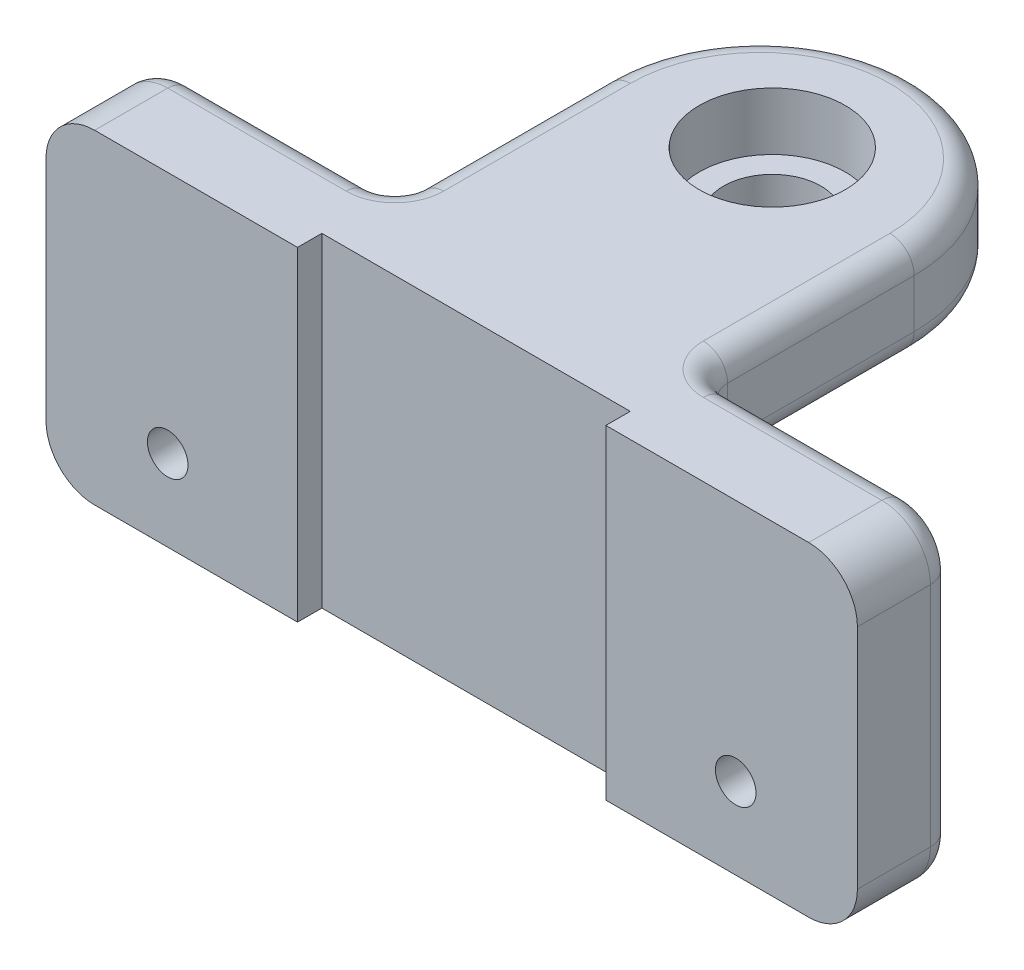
from build123d import *

# Parameters (mm, degrees)
SKETCH1_W                                            = 100
SKETCH1_H                                            = 40
BOSS_EXTRUDE1_DEPTH                                  = 12
BOSS_EXTRUDE2_DEPTH                                  = 12
SKETCH3_W                                            = 38
SKETCH3_H                                            = 3
CUT_EXTRUDE1_DEPTH                                   = 40
CBORE_FOR_M10_HEX_SOCKET_HEAD_CAP_SCREW2_D           = 12
CBORE_FOR_M10_HEX_SOCKET_HEAD_CAP_SCREW2_CBORE_D     = 18
CBORE_FOR_M10_HEX_SOCKET_HEAD_CAP_SCREW2_CBORE_DEPTH = 7.1
FILLET10_R                                           = 6
FILLET11_R                                           = 6
FILLET12_R                                           = 6
FILLET13_R                                           = 6
FILLET14_R                                           = 3
SKETCH11_R                                           = 2.5
CUT_EXTRUDE3_DEPTH                                   = 117.726175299


with BuildPart() as part:
    # Sketch1 → Boss-Extrude1 (new body)
    with BuildSketch(Plane.XY):
        with Locations((50, 20)):
            Rectangle(SKETCH1_W, SKETCH1_H)
    extrude(amount=BOSS_EXTRUDE1_DEPTH)

    # Sketch2 → Boss-Extrude2 (add)
    with BuildSketch(Plane(origin=(0, 40, 0), x_dir=(1, 0, 0), z_dir=(0, 1, 0))):
        with BuildLine():
            Line((31, 0), (31, 26))
            ThreePointArc((31, 26), (50, 45), (69, 26))
            Line((69, 26), (69, 0))
            Line((69, 0), (31, 0))
        make_face()
    extrude(amount=-BOSS_EXTRUDE2_DEPTH)

    # Sketch3 → Cut-Extrude1 (cut)
    with BuildSketch(Plane(origin=(0, 40, 0), x_dir=(1, 0, 0), z_dir=(0, 1, 0))):
        with Locations((50, -10.5)):
            Rectangle(SKETCH3_W, SKETCH3_H)
    extrude(amount=-CUT_EXTRUDE1_DEPTH, mode=Mode.SUBTRACT)

    # CBORE for M10 Hex Socket Head Cap Screw2 (through all)
    with Locations(Plane(origin=(0, 40, 0), x_dir=(1, 0, 0), z_dir=(0, 1, 0))):
        with Locations((49.599303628, 27.905768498)):
            CounterBoreHole(CBORE_FOR_M10_HEX_SOCKET_HEAD_CAP_SCREW2_D / 2, CBORE_FOR_M10_HEX_SOCKET_HEAD_CAP_SCREW2_CBORE_D / 2, CBORE_FOR_M10_HEX_SOCKET_HEAD_CAP_SCREW2_CBORE_DEPTH)

    # Fillet10
    fillet10_edges = [part.edges().sort_by_distance(p)[0] for p in [
        (100, 0, 6),
    ]]
    fillet(fillet10_edges, radius=FILLET10_R)

    # Fillet11
    fillet11_edges = [part.edges().sort_by_distance(p)[0] for p in [
        (100, 40, 6),
    ]]
    fillet(fillet11_edges, radius=FILLET11_R)

    # Fillet12
    fillet12_edges = [part.edges().sort_by_distance(p)[0] for p in [
        (0, 40, 6),
    ]]
    fillet(fillet12_edges, radius=FILLET12_R)

    # Fillet13
    fillet13_edges = [part.edges().sort_by_distance(p)[0] for p in [
        (0, 0, 6),
    ]]
    fillet(fillet13_edges, radius=FILLET13_R)

    # Fillet14
    fillet14_edges = [part.edges().sort_by_distance(p)[0] for p in [
        (18.5, 40, 0),
        (50, 28, 0),
        (69, 34, 0),
        (31, 28, -13),
        (31, 34, 0),
        (50, 28, -45),
        (69, 28, -13),
        (69, 40, -13),
        (50, 40, -45),
        (31, 40, -13),
        (100, 20, 0),
        (98.242640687, 1.757359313, 0),
        (81.5, 40, 0),
        (98.242640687, 38.242640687, 0),
        (0, 20, 0),
        (1.757359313, 38.242640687, 0),
        (50, 0, 0),
        (1.757359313, 1.757359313, 0),
    ]]
    fillet(fillet14_edges, radius=FILLET14_R)

    # Sketch11 → Cut-Extrude3 (cut, through all)
    with BuildSketch(Plane(origin=(0, 0, 0), x_dir=(-1, 0, 0), z_dir=(0, 0, -1))):
        with Locations((-85, 10)):
            Circle(SKETCH11_R)
        with Locations((-15, 10)):
            Circle(SKETCH11_R)
    extrude(amount=-CUT_EXTRUDE3_DEPTH, mode=Mode.SUBTRACT)


solid = part.part
